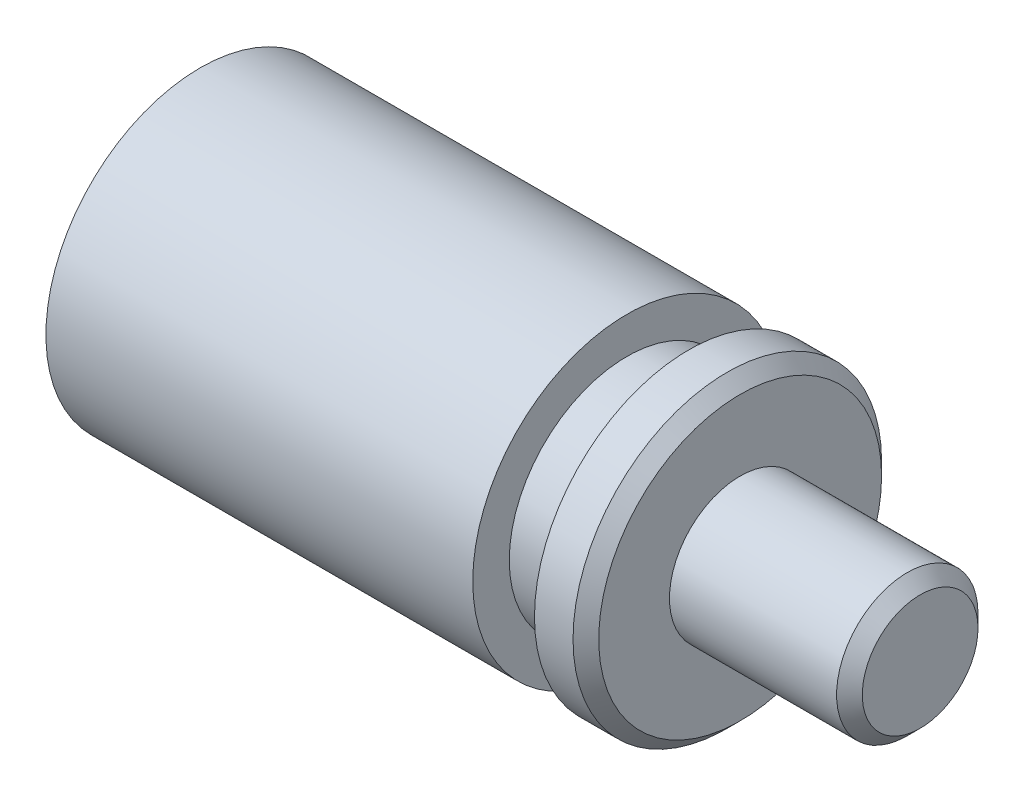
from build123d import *

# Parameters (mm, degrees)
CHAMFER_1_SIZE = 0.5


with BuildPart() as part:
    # Sketch 1 → Revolve 1 (revolve)
    with BuildSketch(Plane.XY, mode=Mode.PRIVATE) as revolve_1_sk:
        with BuildLine():
            Line((0, 0), (0, 2.75))
            Line((0, 2.75), (-7, 2.75))
            Line((-7, 2.75), (-7, 6))
            Line((-7, 6), (-9, 6))
            Line((-9, 6), (-9, 4.58))
            Line((-9, 4.58), (-11.4, 4.58))
            Line((-11.4, 4.58), (-11.4, 6))
            Line((-11.4, 6), (-28, 6))
            ThreePointArc((-28, 6), (-29.486832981, 3.16227766), (-30, 0))
            Line((-30, 0), (0, 0))
        make_face()
    revolve(revolve_1_sk.sketch.rotate(Axis((0, 0, 0), (-1, 0, 0)), 90), axis=Axis((0, 0, 0), (-1, 0, 0)))

    # Chamfer 1
    chamfer_1_edges = [part.edges().sort_by_distance(p)[0] for p in [
        (0, 0, 2.75),
        (-7, 0, 6),
    ]]
    chamfer(chamfer_1_edges, length=CHAMFER_1_SIZE)


solid = part.part
